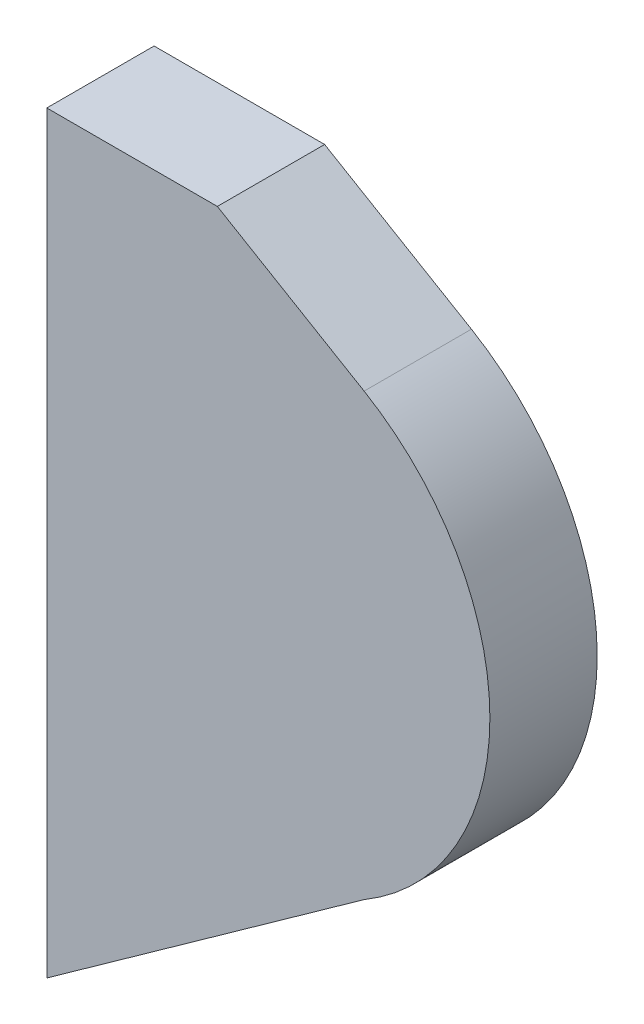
ISO-10303-21;
HEADER;
FILE_DESCRIPTION(('STEP AP214'),'2;1');
FILE_NAME('part.step','',(''),(''),'','','');
FILE_SCHEMA(('AUTOMOTIVE_DESIGN { 1 0 10303 214 1 1 1 1 }'));
ENDSEC;
DATA;
#1=APPLICATION_CONTEXT('core data for automotive mechanical design processes');
#2=APPLICATION_PROTOCOL_DEFINITION('international standard','automotive_design',2000,#1);
#3=PRODUCT_CONTEXT('',#1,'mechanical');
#4=PRODUCT('Part','Part','',(#3));
#5=PRODUCT_RELATED_PRODUCT_CATEGORY('part','',(#4));
#6=PRODUCT_DEFINITION_FORMATION('','',#4);
#7=PRODUCT_DEFINITION_CONTEXT('part definition',#1,'design');
#8=PRODUCT_DEFINITION('design','',#6,#7);
#9=PRODUCT_DEFINITION_SHAPE('','',#8);
#10=(LENGTH_UNIT() NAMED_UNIT(*) SI_UNIT(.MILLI.,.METRE.));
#11=(NAMED_UNIT(*) PLANE_ANGLE_UNIT() SI_UNIT($,.RADIAN.));
#12=(NAMED_UNIT(*) SI_UNIT($,.STERADIAN.) SOLID_ANGLE_UNIT());
#13=UNCERTAINTY_MEASURE_WITH_UNIT(LENGTH_MEASURE(1.E-05),#10,'distance_accuracy_value','');
#14=(GEOMETRIC_REPRESENTATION_CONTEXT(3) GLOBAL_UNCERTAINTY_ASSIGNED_CONTEXT((#13)) GLOBAL_UNIT_ASSIGNED_CONTEXT((#10,
#11,#12)) REPRESENTATION_CONTEXT('',''));
#15=CARTESIAN_POINT('',(0.,0.,0.));
#16=DIRECTION('',(0.,0.,1.));
#17=DIRECTION('',(1.,0.,0.));
#18=AXIS2_PLACEMENT_3D('',#15,#16,#17);
#19=CARTESIAN_POINT('',(14.7874925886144,10.5574628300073,5.));
#20=DIRECTION('',(-0.58105479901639,0.813864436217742,0.));
#21=DIRECTION('',(-0.813864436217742,-0.58105479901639,0.));
#22=AXIS2_PLACEMENT_3D('',#19,#20,#21);
#23=PLANE('',#22);
#24=DIRECTION('',(0.813864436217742,0.58105479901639,0.));
#25=VECTOR('',#24,1.);
#26=CARTESIAN_POINT('',(14.7874925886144,10.5574628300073,0.));
#27=LINE('',#26,#25);
#28=CARTESIAN_POINT('',(0.,0.,0.));
#29=VERTEX_POINT('',#28);
#30=CARTESIAN_POINT('',(14.7874925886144,10.5574628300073,0.));
#31=VERTEX_POINT('',#30);
#32=EDGE_CURVE('E83',#29,#31,#27,.T.);
#33=ORIENTED_EDGE('',*,*,#32,.T.);
#34=DIRECTION('',(0.,0.,-1.));
#35=VECTOR('',#34,1.);
#36=CARTESIAN_POINT('',(14.7874925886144,10.5574628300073,5.));
#37=LINE('',#36,#35);
#38=CARTESIAN_POINT('',(14.7874925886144,10.5574628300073,5.));
#39=VERTEX_POINT('',#38);
#40=EDGE_CURVE('E11',#39,#31,#37,.T.);
#41=ORIENTED_EDGE('',*,*,#40,.F.);
#42=DIRECTION('',(0.813864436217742,0.58105479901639,0.));
#43=VECTOR('',#42,1.);
#44=CARTESIAN_POINT('',(14.7874925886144,10.5574628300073,5.));
#45=LINE('',#44,#43);
#46=CARTESIAN_POINT('',(0.,0.,5.));
#47=VERTEX_POINT('',#46);
#48=EDGE_CURVE('E104',#47,#39,#45,.T.);
#49=ORIENTED_EDGE('',*,*,#48,.F.);
#50=DIRECTION('',(0.,0.,-1.));
#51=VECTOR('',#50,1.);
#52=CARTESIAN_POINT('',(0.,0.,5.));
#53=LINE('',#52,#51);
#54=EDGE_CURVE('E96',#47,#29,#53,.T.);
#55=ORIENTED_EDGE('',*,*,#54,.T.);
#56=EDGE_LOOP('',(#33,#41,#49,#55));
#57=FACE_BOUND('',#56,.T.);
#58=ADVANCED_FACE('F33',(#57),#23,.F.);
#59=CARTESIAN_POINT('',(8.73656900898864,20.8177245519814,5.));
#60=DIRECTION('',(0.,0.,-1.));
#61=DIRECTION('',(-1.,0.,0.));
#62=AXIS2_PLACEMENT_3D('',#59,#60,#61);
#63=CYLINDRICAL_SURFACE('',#62,11.9116181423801);
#64=CARTESIAN_POINT('',(8.73656900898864,20.8177245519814,0.));
#65=DIRECTION('',(0.,0.,1.));
#66=DIRECTION('',(-1.,0.,0.));
#67=AXIS2_PLACEMENT_3D('',#64,#65,#66);
#68=CIRCLE('',#67,11.9116181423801);
#69=CARTESIAN_POINT('',(14.7874925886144,31.0779862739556,0.));
#70=VERTEX_POINT('',#69);
#71=EDGE_CURVE('E79',#31,#70,#68,.T.);
#72=ORIENTED_EDGE('',*,*,#71,.T.);
#73=DIRECTION('',(0.,0.,-1.));
#74=VECTOR('',#73,1.);
#75=CARTESIAN_POINT('',(14.7874925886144,31.0779862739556,5.));
#76=LINE('',#75,#74);
#77=CARTESIAN_POINT('',(14.7874925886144,31.0779862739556,5.));
#78=VERTEX_POINT('',#77);
#79=EDGE_CURVE('E40',#78,#70,#76,.T.);
#80=ORIENTED_EDGE('',*,*,#79,.F.);
#81=CARTESIAN_POINT('',(8.73656900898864,20.8177245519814,5.));
#82=DIRECTION('',(0.,0.,1.));
#83=DIRECTION('',(-1.,0.,0.));
#84=AXIS2_PLACEMENT_3D('',#81,#82,#83);
#85=CIRCLE('',#84,11.9116181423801);
#86=EDGE_CURVE('E92',#39,#78,#85,.T.);
#87=ORIENTED_EDGE('',*,*,#86,.F.);
#88=ORIENTED_EDGE('',*,*,#40,.T.);
#89=EDGE_LOOP('',(#72,#80,#87,#88));
#90=FACE_BOUND('',#89,.T.);
#91=ADVANCED_FACE('F91',(#90),#63,.T.);
#92=CARTESIAN_POINT('',(7.94731810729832,35.1119353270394,5.));
#93=DIRECTION('',(-0.507985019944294,-0.861365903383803,0.));
#94=DIRECTION('',(0.861365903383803,-0.507985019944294,0.));
#95=AXIS2_PLACEMENT_3D('',#92,#93,#94);
#96=PLANE('',#95);
#97=DIRECTION('',(-0.861365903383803,0.507985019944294,0.));
#98=VECTOR('',#97,1.);
#99=CARTESIAN_POINT('',(7.94731810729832,35.1119353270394,0.));
#100=LINE('',#99,#98);
#101=CARTESIAN_POINT('',(7.94731810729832,35.1119353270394,0.));
#102=VERTEX_POINT('',#101);
#103=EDGE_CURVE('E85',#70,#102,#100,.T.);
#104=ORIENTED_EDGE('',*,*,#103,.T.);
#105=DIRECTION('',(0.,0.,-1.));
#106=VECTOR('',#105,1.);
#107=CARTESIAN_POINT('',(7.94731810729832,35.1119353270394,5.));
#108=LINE('',#107,#106);
#109=CARTESIAN_POINT('',(7.94731810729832,35.1119353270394,5.));
#110=VERTEX_POINT('',#109);
#111=EDGE_CURVE('E115',#110,#102,#108,.T.);
#112=ORIENTED_EDGE('',*,*,#111,.F.);
#113=DIRECTION('',(-0.861365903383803,0.507985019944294,0.));
#114=VECTOR('',#113,1.);
#115=CARTESIAN_POINT('',(7.94731810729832,35.1119353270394,5.));
#116=LINE('',#115,#114);
#117=EDGE_CURVE('E107',#78,#110,#116,.T.);
#118=ORIENTED_EDGE('',*,*,#117,.F.);
#119=ORIENTED_EDGE('',*,*,#79,.T.);
#120=EDGE_LOOP('',(#104,#112,#118,#119));
#121=FACE_BOUND('',#120,.T.);
#122=ADVANCED_FACE('F119',(#121),#96,.F.);
#123=CARTESIAN_POINT('',(0.,35.1119353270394,5.));
#124=DIRECTION('',(0.,-1.,0.));
#125=DIRECTION('',(0.,0.,-1.));
#126=AXIS2_PLACEMENT_3D('',#123,#124,#125);
#127=PLANE('',#126);
#128=DIRECTION('',(-1.,0.,0.));
#129=VECTOR('',#128,1.);
#130=CARTESIAN_POINT('',(0.,35.1119353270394,0.));
#131=LINE('',#130,#129);
#132=CARTESIAN_POINT('',(0.,35.1119353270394,0.));
#133=VERTEX_POINT('',#132);
#134=EDGE_CURVE('E100',#102,#133,#131,.T.);
#135=ORIENTED_EDGE('',*,*,#134,.T.);
#136=DIRECTION('',(0.,0.,-1.));
#137=VECTOR('',#136,1.);
#138=CARTESIAN_POINT('',(0.,35.1119353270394,5.));
#139=LINE('',#138,#137);
#140=CARTESIAN_POINT('',(0.,35.1119353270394,5.));
#141=VERTEX_POINT('',#140);
#142=EDGE_CURVE('E112',#141,#133,#139,.T.);
#143=ORIENTED_EDGE('',*,*,#142,.F.);
#144=DIRECTION('',(-1.,0.,0.));
#145=VECTOR('',#144,1.);
#146=CARTESIAN_POINT('',(0.,35.1119353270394,5.));
#147=LINE('',#146,#145);
#148=EDGE_CURVE('E52',#110,#141,#147,.T.);
#149=ORIENTED_EDGE('',*,*,#148,.F.);
#150=ORIENTED_EDGE('',*,*,#111,.T.);
#151=EDGE_LOOP('',(#135,#143,#149,#150));
#152=FACE_BOUND('',#151,.T.);
#153=ADVANCED_FACE('F130',(#152),#127,.F.);
#154=CARTESIAN_POINT('',(0.,0.,5.));
#155=DIRECTION('',(1.,0.,0.));
#156=DIRECTION('',(0.,0.,-1.));
#157=AXIS2_PLACEMENT_3D('',#154,#155,#156);
#158=PLANE('',#157);
#159=DIRECTION('',(0.,-1.,0.));
#160=VECTOR('',#159,1.);
#161=CARTESIAN_POINT('',(0.,0.,0.));
#162=LINE('',#161,#160);
#163=EDGE_CURVE('E102',#133,#29,#162,.T.);
#164=ORIENTED_EDGE('',*,*,#163,.T.);
#165=ORIENTED_EDGE('',*,*,#54,.F.);
#166=DIRECTION('',(0.,-1.,0.));
#167=VECTOR('',#166,1.);
#168=CARTESIAN_POINT('',(0.,0.,5.));
#169=LINE('',#168,#167);
#170=EDGE_CURVE('E47',#141,#47,#169,.T.);
#171=ORIENTED_EDGE('',*,*,#170,.F.);
#172=ORIENTED_EDGE('',*,*,#142,.T.);
#173=EDGE_LOOP('',(#164,#165,#171,#172));
#174=FACE_BOUND('',#173,.T.);
#175=ADVANCED_FACE('F123',(#174),#158,.F.);
#176=CARTESIAN_POINT('',(8.73656900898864,20.8177245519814,5.));
#177=DIRECTION('',(0.,0.,-1.));
#178=DIRECTION('',(-1.,0.,0.));
#179=AXIS2_PLACEMENT_3D('',#176,#177,#178);
#180=PLANE('',#179);
#181=ORIENTED_EDGE('',*,*,#48,.T.);
#182=ORIENTED_EDGE('',*,*,#86,.T.);
#183=ORIENTED_EDGE('',*,*,#117,.T.);
#184=ORIENTED_EDGE('',*,*,#148,.T.);
#185=ORIENTED_EDGE('',*,*,#170,.T.);
#186=EDGE_LOOP('',(#181,#182,#183,#184,#185));
#187=FACE_BOUND('',#186,.T.);
#188=ADVANCED_FACE('F121',(#187),#180,.F.);
#189=CARTESIAN_POINT('',(8.73656900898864,20.8177245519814,0.));
#190=DIRECTION('',(0.,0.,-1.));
#191=DIRECTION('',(-1.,0.,0.));
#192=AXIS2_PLACEMENT_3D('',#189,#190,#191);
#193=PLANE('',#192);
#194=ORIENTED_EDGE('',*,*,#32,.F.);
#195=ORIENTED_EDGE('',*,*,#163,.F.);
#196=ORIENTED_EDGE('',*,*,#134,.F.);
#197=ORIENTED_EDGE('',*,*,#103,.F.);
#198=ORIENTED_EDGE('',*,*,#71,.F.);
#199=EDGE_LOOP('',(#194,#195,#196,#197,#198));
#200=FACE_BOUND('',#199,.T.);
#201=ADVANCED_FACE('F80',(#200),#193,.T.);
#202=CLOSED_SHELL('',(#58,#91,#122,#153,#175,#188,#201));
#203=MANIFOLD_SOLID_BREP('B2',#202);
#204=ADVANCED_BREP_SHAPE_REPRESENTATION('',(#18,#203),#14);
#205=SHAPE_DEFINITION_REPRESENTATION(#9,#204);
ENDSEC;
END-ISO-10303-21;
